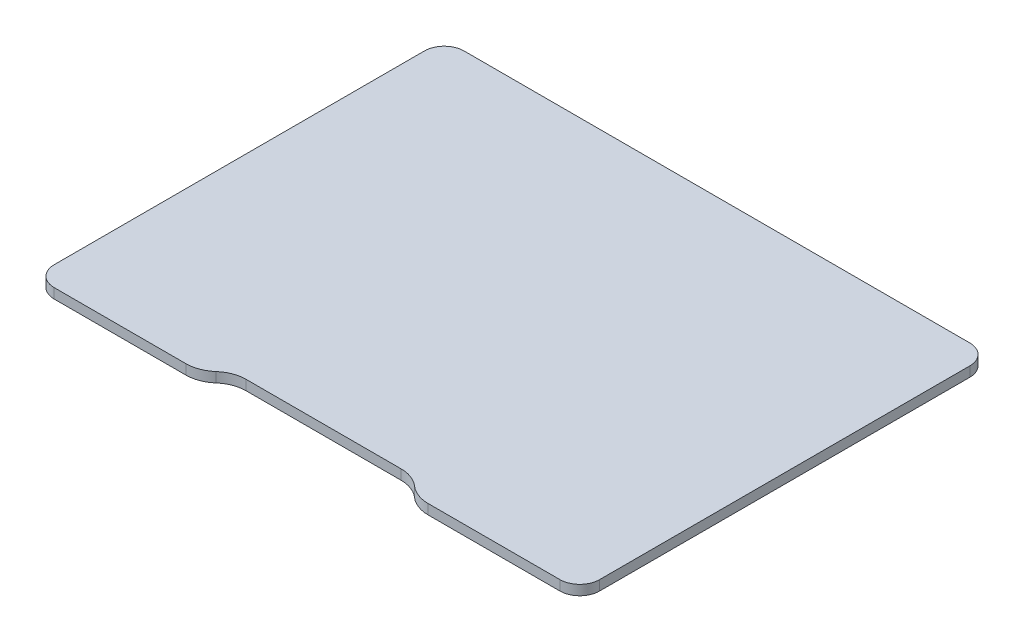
from build123d import *

# Parameters (mm, degrees)
BOSS_EXTRUDE1_DEPTH = 3
FILLET1_R           = 6
FILLET2_R           = 10
FILLET3_R           = 10


with BuildPart() as part:
    # Sketch1 → Boss-Extrude1 (new body)
    with BuildSketch(Plane(origin=(0, 0, 0), x_dir=(1, 0, 0), z_dir=(0, 1, 0))):
        Polygon((-32.5, -62), (-27.5, -57), (27.5, -57), (32.5, -62), (82.5, -62), (82.5, 62), (-82.5, 62), (-82.5, -62), align=None)
    extrude(amount=BOSS_EXTRUDE1_DEPTH)

    # Fillet1
    fillet1_edges = [part.edges().sort_by_distance(p)[0] for p in [
        (-82.5, 1.5, -62),
        (82.5, 1.5, -62),
        (82.5, 1.5, 62),
        (-82.5, 1.5, 62),
    ]]
    fillet(fillet1_edges, radius=FILLET1_R)

    # Fillet2
    fillet2_edges = [part.edges().sort_by_distance(p)[0] for p in [
        (32.5, 1.5, 62),
        (-32.5, 1.5, 62),
    ]]
    fillet(fillet2_edges, radius=FILLET2_R)

    # Fillet3
    fillet3_edges = [part.edges().sort_by_distance(p)[0] for p in [
        (-27.5, 1.5, 57),
        (27.5, 1.5, 57),
    ]]
    fillet(fillet3_edges, radius=FILLET3_R)


solid = part.part
